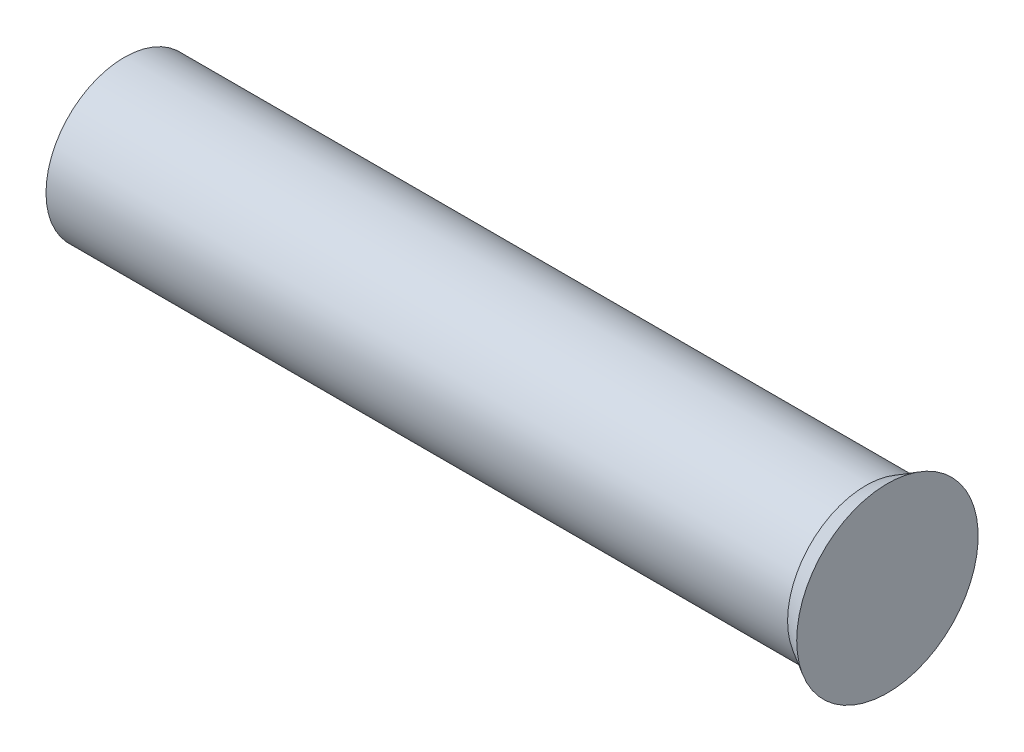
ISO-10303-21;
HEADER;
FILE_DESCRIPTION(('STEP AP214'),'2;1');
FILE_NAME('part.step','',(''),(''),'','','');
FILE_SCHEMA(('AUTOMOTIVE_DESIGN { 1 0 10303 214 1 1 1 1 }'));
ENDSEC;
DATA;
#1=APPLICATION_CONTEXT('core data for automotive mechanical design processes');
#2=APPLICATION_PROTOCOL_DEFINITION('international standard','automotive_design',2000,#1);
#3=PRODUCT_CONTEXT('',#1,'mechanical');
#4=PRODUCT('Part','Part','',(#3));
#5=PRODUCT_RELATED_PRODUCT_CATEGORY('part','',(#4));
#6=PRODUCT_DEFINITION_FORMATION('','',#4);
#7=PRODUCT_DEFINITION_CONTEXT('part definition',#1,'design');
#8=PRODUCT_DEFINITION('design','',#6,#7);
#9=PRODUCT_DEFINITION_SHAPE('','',#8);
#10=(LENGTH_UNIT() NAMED_UNIT(*) SI_UNIT(.MILLI.,.METRE.));
#11=(NAMED_UNIT(*) PLANE_ANGLE_UNIT() SI_UNIT($,.RADIAN.));
#12=(NAMED_UNIT(*) SI_UNIT($,.STERADIAN.) SOLID_ANGLE_UNIT());
#13=UNCERTAINTY_MEASURE_WITH_UNIT(LENGTH_MEASURE(1.E-05),#10,'distance_accuracy_value','');
#14=(GEOMETRIC_REPRESENTATION_CONTEXT(3) GLOBAL_UNCERTAINTY_ASSIGNED_CONTEXT((#13)) GLOBAL_UNIT_ASSIGNED_CONTEXT((#10,
#11,#12)) REPRESENTATION_CONTEXT('',''));
#15=CARTESIAN_POINT('',(0.,0.,0.));
#16=DIRECTION('',(0.,0.,1.));
#17=DIRECTION('',(1.,0.,0.));
#18=AXIS2_PLACEMENT_3D('',#15,#16,#17);
#19=CARTESIAN_POINT('',(4.064,0.,0.));
#20=DIRECTION('',(-1.,0.,0.));
#21=DIRECTION('',(0.,1.,0.));
#22=AXIS2_PLACEMENT_3D('',#19,#20,#21);
#23=SPHERICAL_SURFACE('',#22,4.064);
#24=CARTESIAN_POINT('',(0.52274897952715,0.,0.));
#25=DIRECTION('',(-1.,0.,0.));
#26=DIRECTION('',(0.,0.,1.));
#27=AXIS2_PLACEMENT_3D('',#24,#25,#26);
#28=CIRCLE('',#27,1.9939);
#29=CARTESIAN_POINT('',(0.52274897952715,0.,1.9939));
#30=VERTEX_POINT('',#29);
#31=EDGE_CURVE('E10',#30,#30,#28,.T.);
#32=ORIENTED_EDGE('',*,*,#31,.T.);
#33=EDGE_LOOP('',(#32));
#34=FACE_BOUND('',#33,.T.);
#35=ADVANCED_FACE('F30',(#34),#23,.T.);
#36=CARTESIAN_POINT('',(3.86688815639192,0.,0.));
#37=DIRECTION('',(-1.,0.,0.));
#38=DIRECTION('',(0.,0.,1.));
#39=AXIS2_PLACEMENT_3D('',#36,#37,#38);
#40=CYLINDRICAL_SURFACE('',#39,1.9939);
#41=ORIENTED_EDGE('',*,*,#31,.F.);
#42=EDGE_LOOP('',(#41));
#43=FACE_BOUND('',#42,.T.);
#44=CARTESIAN_POINT('',(19.4144738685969,0.,0.));
#45=DIRECTION('',(-1.,0.,0.));
#46=DIRECTION('',(0.,0.,1.));
#47=AXIS2_PLACEMENT_3D('',#44,#45,#46);
#48=CIRCLE('',#47,1.9939);
#49=CARTESIAN_POINT('',(19.4144738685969,0.,1.9939));
#50=VERTEX_POINT('',#49);
#51=EDGE_CURVE('E36',#50,#50,#48,.T.);
#52=ORIENTED_EDGE('',*,*,#51,.T.);
#53=EDGE_LOOP('',(#52));
#54=FACE_BOUND('',#53,.T.);
#55=ADVANCED_FACE('F55',(#43,#54),#40,.T.);
#56=CARTESIAN_POINT('',(19.9644,0.,0.));
#57=DIRECTION('',(1.,0.,0.));
#58=DIRECTION('',(0.,0.,-1.));
#59=AXIS2_PLACEMENT_3D('',#56,#57,#58);
#60=CONICAL_SURFACE('',#59,2.3114,0.5235987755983);
#61=ORIENTED_EDGE('',*,*,#51,.F.);
#62=EDGE_LOOP('',(#61));
#63=FACE_BOUND('',#62,.T.);
#64=CARTESIAN_POINT('',(19.9644,0.,0.));
#65=DIRECTION('',(-1.,0.,0.));
#66=DIRECTION('',(0.,0.,1.));
#67=AXIS2_PLACEMENT_3D('',#64,#65,#66);
#68=CIRCLE('',#67,2.3114);
#69=CARTESIAN_POINT('',(19.9644,0.,2.3114));
#70=VERTEX_POINT('',#69);
#71=EDGE_CURVE('E40',#70,#70,#68,.T.);
#72=ORIENTED_EDGE('',*,*,#71,.T.);
#73=EDGE_LOOP('',(#72));
#74=FACE_BOUND('',#73,.T.);
#75=ADVANCED_FACE('F47',(#63,#74),#60,.T.);
#76=CARTESIAN_POINT('',(19.9644,2.3114,0.));
#77=DIRECTION('',(-1.,0.,0.));
#78=DIRECTION('',(0.,0.,1.));
#79=AXIS2_PLACEMENT_3D('',#76,#77,#78);
#80=PLANE('',#79);
#81=ORIENTED_EDGE('',*,*,#71,.F.);
#82=EDGE_LOOP('',(#81));
#83=FACE_BOUND('',#82,.T.);
#84=ADVANCED_FACE('F49',(#83),#80,.F.);
#85=CLOSED_SHELL('',(#35,#55,#75,#84));
#86=MANIFOLD_SOLID_BREP('B2',#85);
#87=ADVANCED_BREP_SHAPE_REPRESENTATION('',(#18,#86),#14);
#88=SHAPE_DEFINITION_REPRESENTATION(#9,#87);
ENDSEC;
END-ISO-10303-21;
